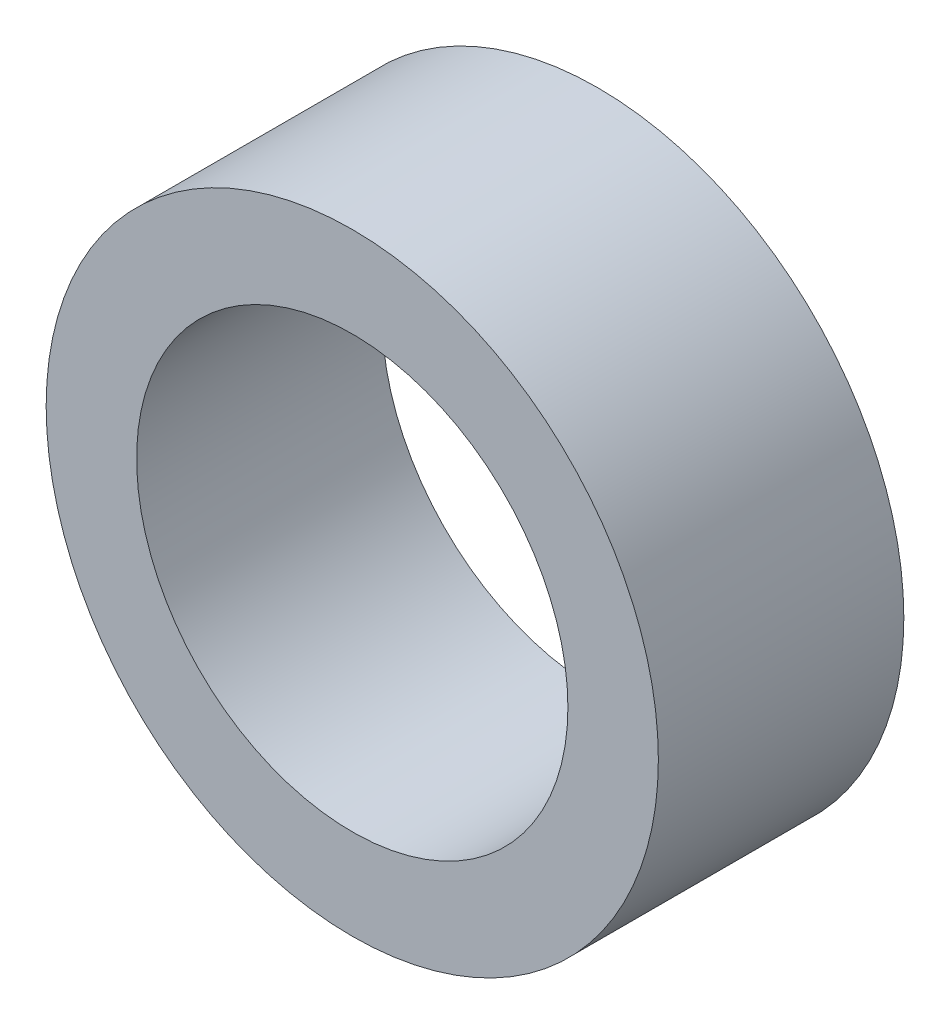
from build123d import *

# Parameters (mm, degrees)
SKETCH1_R           = 15.7734
SKETCH1_R_2         = 11.1125
BOSS_EXTRUDE1_DEPTH = 12.6492


with BuildPart() as part:
    # Sketch1 → Boss-Extrude1 (new body)
    with BuildSketch(Plane.XY):
        Circle(SKETCH1_R)
        Circle(SKETCH1_R_2, mode=Mode.SUBTRACT)
    extrude(amount=BOSS_EXTRUDE1_DEPTH)


solid = part.part
